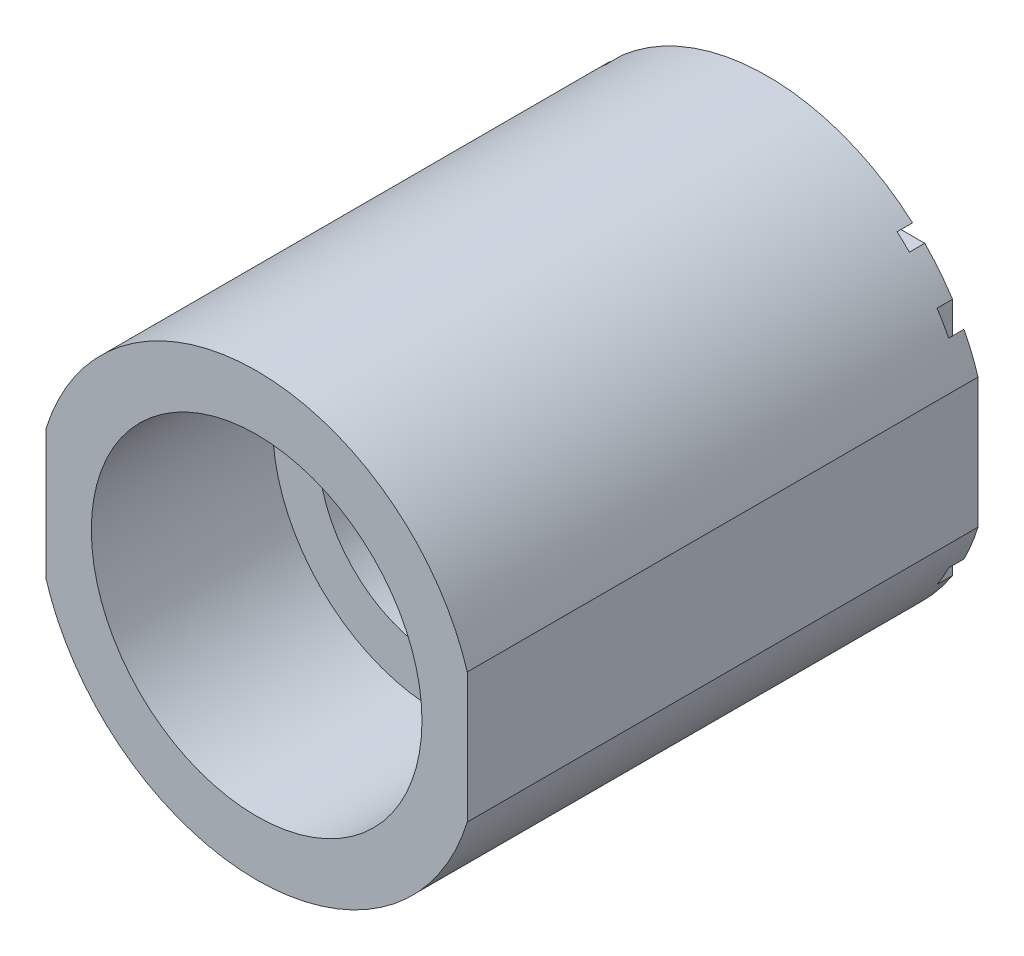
from build123d import *

# Parameters (mm, degrees)
SKETCH1_R                 = 28.575
BOSS_EXTRUDE1_DEPTH       = 67
SKETCH2_R                 = 15.478125
CUT_EXTRUDE1_DEPTH        = 57
SKETCH3_R                 = 21.43125
CUT_EXTRUDE2_DEPTH        = 23.5
CUT_EXTRUDE4_REACH        = 80.244
SKETCH7_R                 = 7.5
CUT_EXTRUDE5_DEPTH        = 79.243601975
SKETCH16_R                = 38.1
CUT_EXTRUDE7_DEPTH        = 0.8
SKETCH17_W                = 1.5
SKETCH17_H                = 57.15
CUT_EXTRUDE8_DEPTH        = 2
SKETCH18_W                = 51
SKETCH18_H                = 1.5
CUT_EXTRUDE9_DEPTH        = 2
F_1_64_TAPPED_HOLE1_D     = 1.5113
F_1_64_TAPPED_HOLE1_DEPTH = 4.9
F_1_64_TAPPED_HOLE1_TIP   = 0.454040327


with BuildPart() as part:
    # Sketch1 → Boss-Extrude1 (new body)
    with BuildSketch(Plane.XY):
        Circle(SKETCH1_R)
    extrude(amount=BOSS_EXTRUDE1_DEPTH)

    # Sketch2 → Cut-Extrude1 (cut)
    with BuildSketch(Plane.XY.offset(67)):
        Circle(SKETCH2_R)
    extrude(amount=-CUT_EXTRUDE1_DEPTH, mode=Mode.SUBTRACT)

    # Sketch3 → Cut-Extrude2 (cut)
    with BuildSketch(Plane.XY.offset(67)):
        Circle(SKETCH3_R)
    extrude(amount=-CUT_EXTRUDE2_DEPTH, mode=Mode.SUBTRACT)

    # Sketch7 → Cut-Extrude4 (cut, up to next)
    with BuildSketch(Plane(origin=(0, 0, 0), x_dir=(-1, 0, 0), z_dir=(0, 0, -1)), mode=Mode.PRIVATE) as cut_extrude4_sk1:
        Circle(SKETCH7_R)
    cut_extrude4_tool1 = extrude(cut_extrude4_sk1.sketch, amount=-CUT_EXTRUDE4_REACH, mode=Mode.PRIVATE) & part.part
    add(cut_extrude4_tool1.solids().sort_by_distance((0, 0, 0))[0], mode=Mode.SUBTRACT)

    # Sketch4 → Cut-Revolve1 (revolve, cut)
    with BuildSketch(Plane(origin=(0, 0, 0), x_dir=(1, 0, 0), z_dir=(0, 1, 0))):
        Polygon((-7.2, -7.729802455), (-8.205460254, -6.8), (-15.39494, -6.8), (-15.39494, 0), (-7.2, 0), align=None)
    revolve(axis=Axis((0, 0, 64), (0, 0, -1)), mode=Mode.SUBTRACT)

    # Sketch10 → Cut-Extrude5 (cut, through all)
    with BuildSketch(Plane.XY.offset(67)):
        with BuildLine():
            Line((-27.305, 8.424226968), (-27.305, -8.424226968))
            ThreePointArc((-27.305, -8.424226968), (-28.575, 0), (-27.305, 8.424226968))
        make_face()
        with BuildLine():
            Line((27.305, 8.424226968), (27.305, -8.424226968))
            ThreePointArc((27.305, -8.424226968), (28.575, 0), (27.305, 8.424226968))
        make_face()
    extrude(amount=-CUT_EXTRUDE5_DEPTH, mode=Mode.SUBTRACT)

    # Sketch16 → Cut-Extrude7 (cut)
    with BuildSketch(Plane(origin=(0, 0, 0), x_dir=(-1, 0, 0), z_dir=(0, 0, -1))):
        Circle(SKETCH16_R)
    extrude(amount=-CUT_EXTRUDE7_DEPTH, mode=Mode.SUBTRACT)

    # Sketch17 → Cut-Extrude8 (cut)
    with BuildSketch(Plane(origin=(0, 0, 0.8), x_dir=(-1, 0, 0), z_dir=(0, 0, -1))):
        with Locations((-24.75, 0)):
            Rectangle(SKETCH17_W, SKETCH17_H)
        with Locations((24.75, 0)):
            Rectangle(SKETCH17_W, SKETCH17_H)
    extrude(amount=-CUT_EXTRUDE8_DEPTH, mode=Mode.SUBTRACT)

    # Sketch18 → Cut-Extrude9 (cut)
    with BuildSketch(Plane(origin=(0, 0, 0.8), x_dir=(-1, 0, 0), z_dir=(0, 0, -1))):
        with Locations((0, 20.75)):
            Rectangle(SKETCH18_W, SKETCH18_H)
    extrude(amount=-CUT_EXTRUDE9_DEPTH, mode=Mode.SUBTRACT)

    # 1-64 Tapped Hole1
    with Locations(Plane(origin=(0, 0, 0.8), x_dir=(-1, 0, 0), z_dir=(0, 0, -1))):
        with Locations((0, 22.475)):
            Hole(F_1_64_TAPPED_HOLE1_D / 2, depth=F_1_64_TAPPED_HOLE1_DEPTH)
            with Locations((0, 0, -(F_1_64_TAPPED_HOLE1_DEPTH + F_1_64_TAPPED_HOLE1_TIP / 2))):  # 118° drill point
                Cone(0, F_1_64_TAPPED_HOLE1_D / 2, F_1_64_TAPPED_HOLE1_TIP, mode=Mode.SUBTRACT)


solid = part.part
